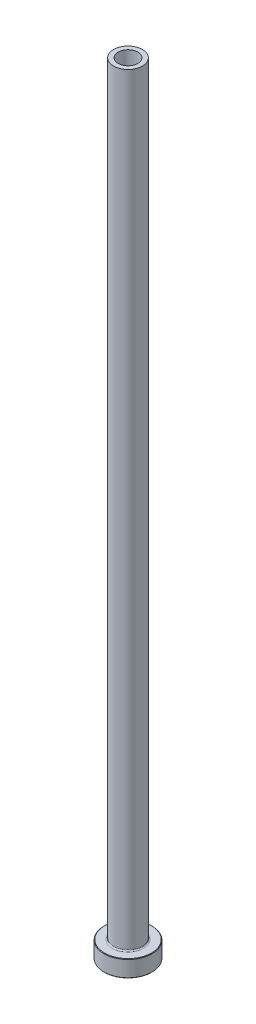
from build123d import *

# Parameters (mm, degrees)
FILLET1_R     = 0.5
CHAMFER1_SIZE = 0.2
CHAMFER3_SIZE = 0.5


with BuildPart() as part:
    # Sketch1 → Revolve1 (revolve)
    with BuildSketch(Plane.XY, mode=Mode.PRIVATE) as revolve1_sk:
        Polygon((-4.1, 325), (-6, 325), (-6, 7), (-10, 7), (-10, 0), (-4.35, 0), (-4.35, 268), (-4.1, 280), align=None)
    revolve(revolve1_sk.sketch.rotate(Axis((0, 92.187680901, 0), (0, -1, 0)), 270), axis=Axis((0, 92.187680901, 0), (0, -1, 0)))

    # Fillet1
    fillet1_edges = [part.edges().sort_by_distance(p)[0] for p in [
        (0, 7, -6),
    ]]
    fillet(fillet1_edges, radius=FILLET1_R)

    # Chamfer1
    chamfer1_edges = [part.edges().sort_by_distance(p)[0] for p in [
        (0, 0, -10),
        (0, 7, -10),
    ]]
    chamfer(chamfer1_edges, length=CHAMFER1_SIZE)

    # Chamfer3
    chamfer3_edges = [part.edges().sort_by_distance(p)[0] for p in [
        (0, 0, -4.35),
    ]]
    chamfer(chamfer3_edges, length=CHAMFER3_SIZE)


solid = part.part
